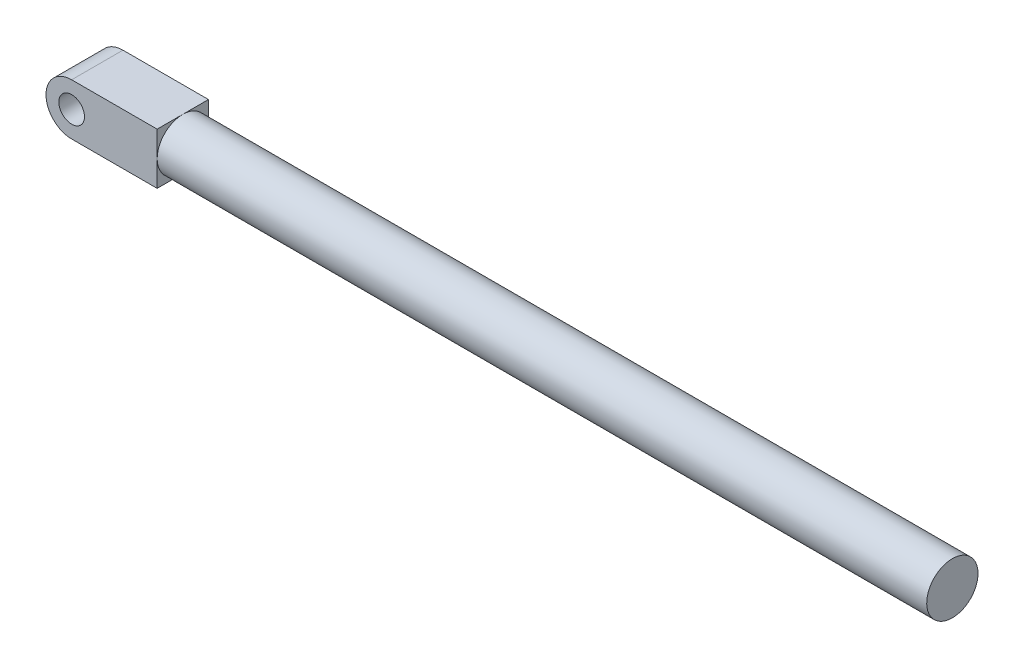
from build123d import *

# Parameters (mm, degrees)
ESQUISSE1_R          = 0.75
BASE_EXTRUSION_DEPTH = 3
ESQUISSE2_R          = 1.5
BOSS_EXTRU_1_DEPTH   = 45


with BuildPart() as part:
    # Esquisse1 → Base-Extrusion (new body)
    with BuildSketch(Plane.XY):
        with BuildLine():
            Line((0, 1.5), (5, 1.5))
            Line((5, 1.5), (5, -1.5))
            Line((5, -1.5), (0, -1.5))
            ThreePointArc((0, -1.5), (-1.5, 0), (0, 1.5))
        make_face()
        Circle(ESQUISSE1_R, mode=Mode.SUBTRACT)
    extrude(amount=BASE_EXTRUSION_DEPTH)

    # Esquisse2 → Boss.-Extru.1 (add)
    with BuildSketch(Plane(origin=(5, 0, 0), x_dir=(0, 0, -1), z_dir=(1, 0, 0))):
        with Locations(Location((-1.5, 0, 0), (0, 0, 90))):
            Circle(ESQUISSE2_R)
    extrude(amount=BOSS_EXTRU_1_DEPTH)


solid = part.part
